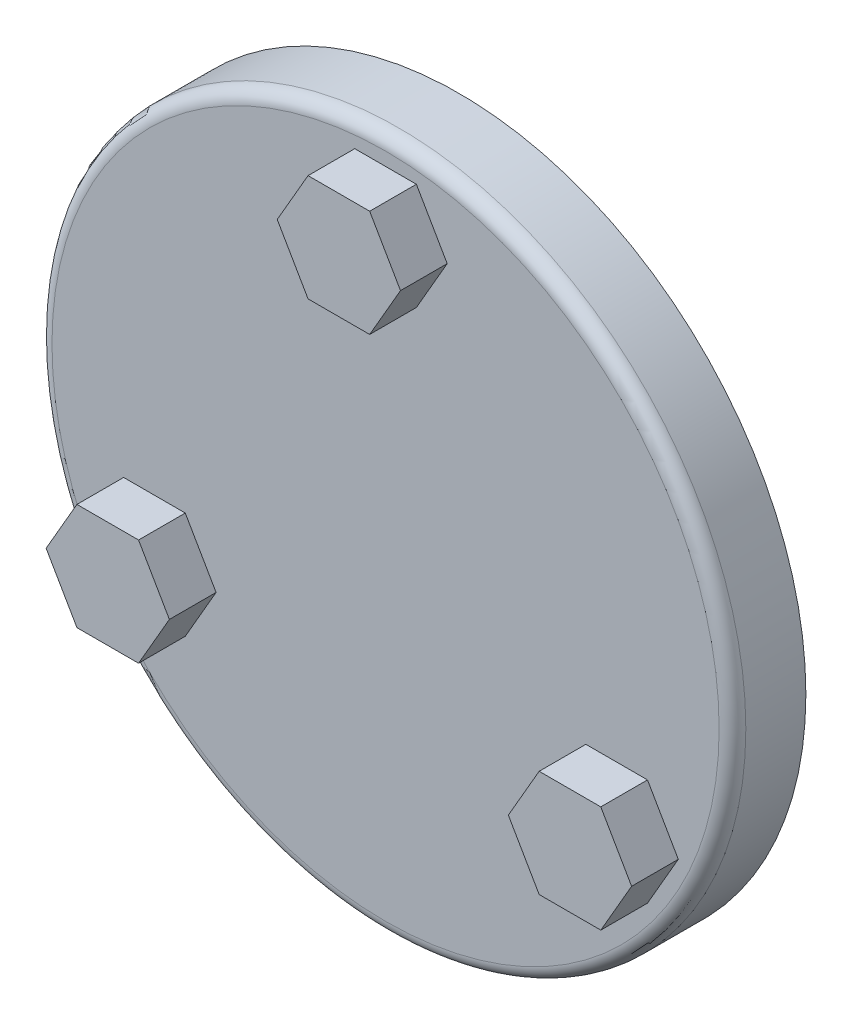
ISO-10303-21;
HEADER;
FILE_DESCRIPTION(('STEP AP214'),'2;1');
FILE_NAME('part.step','',(''),(''),'','','');
FILE_SCHEMA(('AUTOMOTIVE_DESIGN { 1 0 10303 214 1 1 1 1 }'));
ENDSEC;
DATA;
#1=APPLICATION_CONTEXT('core data for automotive mechanical design processes');
#2=APPLICATION_PROTOCOL_DEFINITION('international standard','automotive_design',2000,#1);
#3=PRODUCT_CONTEXT('',#1,'mechanical');
#4=PRODUCT('Part','Part','',(#3));
#5=PRODUCT_RELATED_PRODUCT_CATEGORY('part','',(#4));
#6=PRODUCT_DEFINITION_FORMATION('','',#4);
#7=PRODUCT_DEFINITION_CONTEXT('part definition',#1,'design');
#8=PRODUCT_DEFINITION('design','',#6,#7);
#9=PRODUCT_DEFINITION_SHAPE('','',#8);
#10=(LENGTH_UNIT() NAMED_UNIT(*) SI_UNIT(.MILLI.,.METRE.));
#11=(NAMED_UNIT(*) PLANE_ANGLE_UNIT() SI_UNIT($,.RADIAN.));
#12=(NAMED_UNIT(*) SI_UNIT($,.STERADIAN.) SOLID_ANGLE_UNIT());
#13=UNCERTAINTY_MEASURE_WITH_UNIT(LENGTH_MEASURE(1.E-05),#10,'distance_accuracy_value','');
#14=(GEOMETRIC_REPRESENTATION_CONTEXT(3) GLOBAL_UNCERTAINTY_ASSIGNED_CONTEXT((#13)) GLOBAL_UNIT_ASSIGNED_CONTEXT((#10,
#11,#12)) REPRESENTATION_CONTEXT('',''));
#15=CARTESIAN_POINT('',(0.,0.,0.));
#16=DIRECTION('',(0.,0.,1.));
#17=DIRECTION('',(1.,0.,0.));
#18=AXIS2_PLACEMENT_3D('',#15,#16,#17);
#19=CARTESIAN_POINT('',(16.165807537,-4.,9.));
#20=DIRECTION('',(0.,0.,1.));
#21=DIRECTION('',(-0.499999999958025,-0.866025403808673,0.));
#22=AXIS2_PLACEMENT_3D('',#19,#20,#21);
#23=PLANE('',#22);
#24=DIRECTION('',(0.500000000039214,-0.866025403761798,0.));
#25=VECTOR('',#24,1.);
#26=CARTESIAN_POINT('',(13.8564064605,-12.,9.));
#27=LINE('',#26,#25);
#28=CARTESIAN_POINT('',(12.701705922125,-10.,9.));
#29=VERTEX_POINT('',#28);
#30=CARTESIAN_POINT('',(15.011106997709,-13.9999999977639,9.));
#31=VERTEX_POINT('',#30);
#32=EDGE_CURVE('E263',#29,#31,#27,.T.);
#33=ORIENTED_EDGE('',*,*,#32,.T.);
#34=DIRECTION('',(1.,0.,0.));
#35=VECTOR('',#34,1.);
#36=CARTESIAN_POINT('',(17.3205080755,-14.,9.));
#37=LINE('',#36,#35);
#38=CARTESIAN_POINT('',(19.62990915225,-14.,9.));
#39=VERTEX_POINT('',#38);
#40=EDGE_CURVE('E258',#31,#39,#37,.T.);
#41=ORIENTED_EDGE('',*,*,#40,.T.);
#42=DIRECTION('',(0.500000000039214,0.866025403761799,0.));
#43=VECTOR('',#42,1.);
#44=CARTESIAN_POINT('',(20.7846096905,-12.,9.));
#45=LINE('',#44,#43);
#46=CARTESIAN_POINT('',(21.93931022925,-10.,9.));
#47=VERTEX_POINT('',#46);
#48=EDGE_CURVE('E259',#39,#47,#45,.T.);
#49=ORIENTED_EDGE('',*,*,#48,.T.);
#50=DIRECTION('',(-0.500000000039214,0.866025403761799,0.));
#51=VECTOR('',#50,1.);
#52=CARTESIAN_POINT('',(20.7846096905,-8.,9.));
#53=LINE('',#52,#51);
#54=CARTESIAN_POINT('',(19.6299091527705,-6.00000000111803,9.));
#55=VERTEX_POINT('',#54);
#56=EDGE_CURVE('E329',#47,#55,#53,.T.);
#57=ORIENTED_EDGE('',*,*,#56,.T.);
#58=DIRECTION('',(-1.,0.,0.));
#59=VECTOR('',#58,1.);
#60=CARTESIAN_POINT('',(17.3205080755,-6.,9.));
#61=LINE('',#60,#59);
#62=CARTESIAN_POINT('',(15.011106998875,-6.,9.));
#63=VERTEX_POINT('',#62);
#64=EDGE_CURVE('E250',#55,#63,#61,.T.);
#65=ORIENTED_EDGE('',*,*,#64,.T.);
#66=DIRECTION('',(-0.500000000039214,-0.866025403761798,0.));
#67=VECTOR('',#66,1.);
#68=CARTESIAN_POINT('',(13.8564064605,-8.,9.));
#69=LINE('',#68,#67);
#70=EDGE_CURVE('E245',#63,#29,#69,.T.);
#71=ORIENTED_EDGE('',*,*,#70,.T.);
#72=EDGE_LOOP('',(#33,#41,#49,#57,#65,#71));
#73=FACE_BOUND('',#72,.T.);
#74=ADVANCED_FACE('F16',(#73),#23,.T.);
#75=CARTESIAN_POINT('',(-4.618802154,16.,9.));
#76=DIRECTION('',(0.,0.,1.));
#77=DIRECTION('',(1.,0.,0.));
#78=AXIS2_PLACEMENT_3D('',#75,#76,#77);
#79=PLANE('',#78);
#80=DIRECTION('',(0.500000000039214,0.866025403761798,0.));
#81=VECTOR('',#80,1.);
#82=CARTESIAN_POINT('',(3.4641016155,18.,9.));
#83=LINE('',#82,#81);
#84=CARTESIAN_POINT('',(2.309401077,16.,9.));
#85=VERTEX_POINT('',#84);
#86=CARTESIAN_POINT('',(4.61880215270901,19.999999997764,9.));
#87=VERTEX_POINT('',#86);
#88=EDGE_CURVE('E235',#85,#87,#83,.T.);
#89=ORIENTED_EDGE('',*,*,#88,.T.);
#90=DIRECTION('',(-0.500000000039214,0.866025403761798,0.));
#91=VECTOR('',#90,1.);
#92=CARTESIAN_POINT('',(3.4641016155,22.,9.));
#93=LINE('',#92,#91);
#94=CARTESIAN_POINT('',(2.309401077,24.,9.));
#95=VERTEX_POINT('',#94);
#96=EDGE_CURVE('E227',#87,#95,#93,.T.);
#97=ORIENTED_EDGE('',*,*,#96,.T.);
#98=DIRECTION('',(-1.,0.,0.));
#99=VECTOR('',#98,1.);
#100=CARTESIAN_POINT('',(0.,24.,9.));
#101=LINE('',#100,#99);
#102=CARTESIAN_POINT('',(-2.309401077,24.,9.));
#103=VERTEX_POINT('',#102);
#104=EDGE_CURVE('E228',#95,#103,#101,.T.);
#105=ORIENTED_EDGE('',*,*,#104,.T.);
#106=DIRECTION('',(-0.500000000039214,-0.866025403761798,0.));
#107=VECTOR('',#106,1.);
#108=CARTESIAN_POINT('',(-3.4641016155,22.,9.));
#109=LINE('',#108,#107);
#110=CARTESIAN_POINT('',(-4.6188021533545,20.000000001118,9.));
#111=VERTEX_POINT('',#110);
#112=EDGE_CURVE('E249',#103,#111,#109,.T.);
#113=ORIENTED_EDGE('',*,*,#112,.T.);
#114=DIRECTION('',(0.500000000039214,-0.866025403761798,0.));
#115=VECTOR('',#114,1.);
#116=CARTESIAN_POINT('',(-3.4641016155,18.,9.));
#117=LINE('',#116,#115);
#118=CARTESIAN_POINT('',(-2.309401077,16.,9.));
#119=VERTEX_POINT('',#118);
#120=EDGE_CURVE('E215',#111,#119,#117,.T.);
#121=ORIENTED_EDGE('',*,*,#120,.T.);
#122=DIRECTION('',(1.,0.,0.));
#123=VECTOR('',#122,1.);
#124=CARTESIAN_POINT('',(0.,16.,9.));
#125=LINE('',#124,#123);
#126=EDGE_CURVE('E239',#119,#85,#125,.T.);
#127=ORIENTED_EDGE('',*,*,#126,.T.);
#128=EDGE_LOOP('',(#89,#97,#105,#113,#121,#127));
#129=FACE_BOUND('',#128,.T.);
#130=ADVANCED_FACE('F376',(#129),#79,.T.);
#131=CARTESIAN_POINT('',(-11.547005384,-12.,9.));
#132=DIRECTION('',(0.,0.,1.));
#133=DIRECTION('',(-0.499999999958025,0.866025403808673,0.));
#134=AXIS2_PLACEMENT_3D('',#131,#132,#133);
#135=PLANE('',#134);
#136=DIRECTION('',(-1.,0.,0.));
#137=VECTOR('',#136,1.);
#138=CARTESIAN_POINT('',(-17.3205080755,-6.,9.));
#139=LINE('',#138,#137);
#140=CARTESIAN_POINT('',(-15.011106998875,-6.,9.));
#141=VERTEX_POINT('',#140);
#142=CARTESIAN_POINT('',(-19.629909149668,-6.,9.));
#143=VERTEX_POINT('',#142);
#144=EDGE_CURVE('E206',#141,#143,#139,.T.);
#145=ORIENTED_EDGE('',*,*,#144,.T.);
#146=DIRECTION('',(-0.500000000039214,-0.866025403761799,0.));
#147=VECTOR('',#146,1.);
#148=CARTESIAN_POINT('',(-20.7846096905,-8.,9.));
#149=LINE('',#148,#147);
#150=CARTESIAN_POINT('',(-21.93931022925,-10.,9.));
#151=VERTEX_POINT('',#150);
#152=EDGE_CURVE('E201',#143,#151,#149,.T.);
#153=ORIENTED_EDGE('',*,*,#152,.T.);
#154=DIRECTION('',(0.500000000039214,-0.866025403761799,0.));
#155=VECTOR('',#154,1.);
#156=CARTESIAN_POINT('',(-20.7846096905,-12.,9.));
#157=LINE('',#156,#155);
#158=CARTESIAN_POINT('',(-19.62990915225,-14.,9.));
#159=VERTEX_POINT('',#158);
#160=EDGE_CURVE('E202',#151,#159,#157,.T.);
#161=ORIENTED_EDGE('',*,*,#160,.T.);
#162=DIRECTION('',(1.,0.,0.));
#163=VECTOR('',#162,1.);
#164=CARTESIAN_POINT('',(-17.3205080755,-14.,9.));
#165=LINE('',#164,#163);
#166=CARTESIAN_POINT('',(-15.011107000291,-14.,9.));
#167=VERTEX_POINT('',#166);
#168=EDGE_CURVE('E214',#159,#167,#165,.T.);
#169=ORIENTED_EDGE('',*,*,#168,.T.);
#170=DIRECTION('',(0.500000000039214,0.866025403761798,0.));
#171=VECTOR('',#170,1.);
#172=CARTESIAN_POINT('',(-13.8564064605,-12.,9.));
#173=LINE('',#172,#171);
#174=CARTESIAN_POINT('',(-12.701705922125,-10.,9.));
#175=VERTEX_POINT('',#174);
#176=EDGE_CURVE('E97',#167,#175,#173,.T.);
#177=ORIENTED_EDGE('',*,*,#176,.T.);
#178=DIRECTION('',(-0.500000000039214,0.866025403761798,0.));
#179=VECTOR('',#178,1.);
#180=CARTESIAN_POINT('',(-13.8564064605,-8.,9.));
#181=LINE('',#180,#179);
#182=EDGE_CURVE('E210',#175,#141,#181,.T.);
#183=ORIENTED_EDGE('',*,*,#182,.T.);
#184=EDGE_LOOP('',(#145,#153,#161,#169,#177,#183));
#185=FACE_BOUND('',#184,.T.);
#186=ADVANCED_FACE('F373',(#185),#135,.T.);
#187=CARTESIAN_POINT('',(-26.312,-26.312,0.));
#188=DIRECTION('',(0.,0.,1.));
#189=DIRECTION('',(1.,0.,0.));
#190=AXIS2_PLACEMENT_3D('',#187,#188,#189);
#191=PLANE('',#190);
#192=CARTESIAN_POINT('',(0.,0.,0.));
#193=DIRECTION('',(0.,0.,-1.));
#194=DIRECTION('',(-1.,0.,0.));
#195=AXIS2_PLACEMENT_3D('',#192,#193,#194);
#196=CIRCLE('',#195,26.);
#197=CARTESIAN_POINT('',(-26.,0.,0.));
#198=VERTEX_POINT('',#197);
#199=EDGE_CURVE('E20',#198,#198,#196,.T.);
#200=ORIENTED_EDGE('',*,*,#199,.T.);
#201=EDGE_LOOP('',(#200));
#202=FACE_BOUND('',#201,.T.);
#203=ADVANCED_FACE('F375',(#202),#191,.F.);
#204=CARTESIAN_POINT('',(19.629909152,-6.,5.5));
#205=DIRECTION('',(-0.866025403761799,-0.500000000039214,0.));
#206=DIRECTION('',(0.500000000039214,-0.866025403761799,0.));
#207=AXIS2_PLACEMENT_3D('',#204,#205,#206);
#208=PLANE('',#207);
#209=DIRECTION('',(0.,0.,1.));
#210=VECTOR('',#209,1.);
#211=CARTESIAN_POINT('',(19.629909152,-6.,7.25));
#212=LINE('',#211,#210);
#213=CARTESIAN_POINT('',(19.6299091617,-5.99999999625,5.5));
#214=VERTEX_POINT('',#213);
#215=EDGE_CURVE('E244',#214,#55,#212,.T.);
#216=ORIENTED_EDGE('',*,*,#215,.T.);
#217=ORIENTED_EDGE('',*,*,#56,.F.);
#218=DIRECTION('',(0.,0.,-1.));
#219=VECTOR('',#218,1.);
#220=CARTESIAN_POINT('',(21.939310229,-10.,7.25));
#221=LINE('',#220,#219);
#222=CARTESIAN_POINT('',(21.9393102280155,-9.99999998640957,5.5));
#223=VERTEX_POINT('',#222);
#224=EDGE_CURVE('E255',#47,#223,#221,.T.);
#225=ORIENTED_EDGE('',*,*,#224,.T.);
#226=DIRECTION('',(0.499999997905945,-0.866025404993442,0.));
#227=VECTOR('',#226,1.);
#228=CARTESIAN_POINT('',(19.6299091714,-5.999999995,5.5));
#229=LINE('',#228,#227);
#230=EDGE_CURVE('E88',#214,#223,#229,.T.);
#231=ORIENTED_EDGE('',*,*,#230,.F.);
#232=EDGE_LOOP('',(#216,#217,#225,#231));
#233=FACE_BOUND('',#232,.T.);
#234=ADVANCED_FACE('F342',(#233),#208,.F.);
#235=CARTESIAN_POINT('',(21.939310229,-10.,5.5));
#236=DIRECTION('',(-0.866025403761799,0.500000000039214,0.));
#237=DIRECTION('',(-0.500000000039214,-0.866025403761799,0.));
#238=AXIS2_PLACEMENT_3D('',#235,#236,#237);
#239=PLANE('',#238);
#240=ORIENTED_EDGE('',*,*,#224,.F.);
#241=ORIENTED_EDGE('',*,*,#48,.F.);
#242=DIRECTION('',(0.,0.,-1.));
#243=VECTOR('',#242,1.);
#244=CARTESIAN_POINT('',(19.629909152,-14.,7.25));
#245=LINE('',#244,#243);
#246=CARTESIAN_POINT('',(19.6299091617,-14.0000000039,5.5));
#247=VERTEX_POINT('',#246);
#248=EDGE_CURVE('E260',#39,#247,#245,.T.);
#249=ORIENTED_EDGE('',*,*,#248,.T.);
#250=DIRECTION('',(-0.499999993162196,-0.866025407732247,0.));
#251=VECTOR('',#250,1.);
#252=CARTESIAN_POINT('',(21.9393102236,-9.9999999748,5.5));
#253=LINE('',#252,#251);
#254=EDGE_CURVE('E178',#223,#247,#253,.T.);
#255=ORIENTED_EDGE('',*,*,#254,.F.);
#256=EDGE_LOOP('',(#240,#241,#249,#255));
#257=FACE_BOUND('',#256,.T.);
#258=ADVANCED_FACE('F345',(#257),#239,.F.);
#259=CARTESIAN_POINT('',(19.629909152,-14.,5.5));
#260=DIRECTION('',(0.,1.,0.));
#261=DIRECTION('',(-1.,0.,0.));
#262=AXIS2_PLACEMENT_3D('',#259,#260,#261);
#263=PLANE('',#262);
#264=ORIENTED_EDGE('',*,*,#248,.F.);
#265=ORIENTED_EDGE('',*,*,#40,.F.);
#266=DIRECTION('',(0.,0.,-1.));
#267=VECTOR('',#266,1.);
#268=CARTESIAN_POINT('',(15.011106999,-14.,7.25));
#269=LINE('',#268,#267);
#270=CARTESIAN_POINT('',(15.0111070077,-14.0000000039,5.5));
#271=VERTEX_POINT('',#270);
#272=EDGE_CURVE('E266',#31,#271,#269,.T.);
#273=ORIENTED_EDGE('',*,*,#272,.T.);
#274=DIRECTION('',(-1.,0.,0.));
#275=VECTOR('',#274,1.);
#276=CARTESIAN_POINT('',(0.,-14.0000000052,5.5));
#277=LINE('',#276,#275);
#278=EDGE_CURVE('E177',#247,#271,#277,.T.);
#279=ORIENTED_EDGE('',*,*,#278,.F.);
#280=EDGE_LOOP('',(#264,#265,#273,#279));
#281=FACE_BOUND('',#280,.T.);
#282=ADVANCED_FACE('F347',(#281),#263,.F.);
#283=CARTESIAN_POINT('',(15.011106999,-14.,5.5));
#284=DIRECTION('',(0.866025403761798,0.500000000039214,0.));
#285=DIRECTION('',(-0.500000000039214,0.866025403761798,0.));
#286=AXIS2_PLACEMENT_3D('',#283,#284,#285);
#287=PLANE('',#286);
#288=ORIENTED_EDGE('',*,*,#272,.F.);
#289=ORIENTED_EDGE('',*,*,#32,.F.);
#290=DIRECTION('',(0.,0.,-1.));
#291=VECTOR('',#290,1.);
#292=CARTESIAN_POINT('',(12.701705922,-10.,7.25));
#293=LINE('',#292,#291);
#294=CARTESIAN_POINT('',(12.701705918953,-9.99999998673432,5.5));
#295=VERTEX_POINT('',#294);
#296=EDGE_CURVE('E242',#29,#295,#293,.T.);
#297=ORIENTED_EDGE('',*,*,#296,.T.);
#298=DIRECTION('',(-0.50000000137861,0.866025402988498,0.));
#299=VECTOR('',#298,1.);
#300=CARTESIAN_POINT('',(15.0111070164,-14.0000000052,5.5));
#301=LINE('',#300,#299);
#302=EDGE_CURVE('E173',#271,#295,#301,.T.);
#303=ORIENTED_EDGE('',*,*,#302,.F.);
#304=EDGE_LOOP('',(#288,#289,#297,#303));
#305=FACE_BOUND('',#304,.T.);
#306=ADVANCED_FACE('F449',(#305),#287,.F.);
#307=CARTESIAN_POINT('',(12.701705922,-10.,5.5));
#308=DIRECTION('',(0.866025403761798,-0.500000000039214,0.));
#309=DIRECTION('',(0.500000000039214,0.866025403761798,0.));
#310=AXIS2_PLACEMENT_3D('',#307,#308,#309);
#311=PLANE('',#310);
#312=ORIENTED_EDGE('',*,*,#296,.F.);
#313=ORIENTED_EDGE('',*,*,#70,.F.);
#314=DIRECTION('',(0.,0.,-1.));
#315=VECTOR('',#314,1.);
#316=CARTESIAN_POINT('',(15.011106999,-6.,7.25));
#317=LINE('',#316,#315);
#318=CARTESIAN_POINT('',(15.0111070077,-5.99999999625,5.5));
#319=VERTEX_POINT('',#318);
#320=EDGE_CURVE('E246',#63,#319,#317,.T.);
#321=ORIENTED_EDGE('',*,*,#320,.T.);
#322=DIRECTION('',(0.50000000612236,0.866025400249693,0.));
#323=VECTOR('',#322,1.);
#324=CARTESIAN_POINT('',(12.7017059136,-9.9999999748,5.5));
#325=LINE('',#324,#323);
#326=EDGE_CURVE('E169',#295,#319,#325,.T.);
#327=ORIENTED_EDGE('',*,*,#326,.F.);
#328=EDGE_LOOP('',(#312,#313,#321,#327));
#329=FACE_BOUND('',#328,.T.);
#330=ADVANCED_FACE('F458',(#329),#311,.F.);
#331=CARTESIAN_POINT('',(15.011106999,-6.,5.5));
#332=DIRECTION('',(0.,-1.,0.));
#333=DIRECTION('',(1.,0.,0.));
#334=AXIS2_PLACEMENT_3D('',#331,#332,#333);
#335=PLANE('',#334);
#336=ORIENTED_EDGE('',*,*,#320,.F.);
#337=ORIENTED_EDGE('',*,*,#64,.F.);
#338=ORIENTED_EDGE('',*,*,#215,.F.);
#339=DIRECTION('',(1.,0.,0.));
#340=VECTOR('',#339,1.);
#341=CARTESIAN_POINT('',(0.,-5.999999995,5.5));
#342=LINE('',#341,#340);
#343=EDGE_CURVE('E168',#319,#214,#342,.T.);
#344=ORIENTED_EDGE('',*,*,#343,.F.);
#345=EDGE_LOOP('',(#336,#337,#338,#344));
#346=FACE_BOUND('',#345,.T.);
#347=ADVANCED_FACE('F468',(#346),#335,.F.);
#348=CARTESIAN_POINT('',(-4.618802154,20.,5.5));
#349=DIRECTION('',(0.866025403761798,-0.500000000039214,0.));
#350=DIRECTION('',(0.500000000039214,0.866025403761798,0.));
#351=AXIS2_PLACEMENT_3D('',#348,#349,#350);
#352=PLANE('',#351);
#353=DIRECTION('',(0.,0.,1.));
#354=VECTOR('',#353,1.);
#355=CARTESIAN_POINT('',(-4.618802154,20.,7.25));
#356=LINE('',#355,#354);
#357=CARTESIAN_POINT('',(-4.61880215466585,20.0000000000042,5.5));
#358=VERTEX_POINT('',#357);
#359=EDGE_CURVE('E219',#358,#111,#356,.T.);
#360=ORIENTED_EDGE('',*,*,#359,.T.);
#361=ORIENTED_EDGE('',*,*,#112,.F.);
#362=DIRECTION('',(0.,0.,-1.));
#363=VECTOR('',#362,1.);
#364=CARTESIAN_POINT('',(-2.309401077,24.,7.25));
#365=LINE('',#364,#363);
#366=CARTESIAN_POINT('',(-2.3094010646,23.999999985,5.5));
#367=VERTEX_POINT('',#366);
#368=EDGE_CURVE('E224',#103,#367,#365,.T.);
#369=ORIENTED_EDGE('',*,*,#368,.T.);
#370=DIRECTION('',(0.500000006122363,0.866025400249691,0.));
#371=VECTOR('',#370,1.);
#372=CARTESIAN_POINT('',(-4.618802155,20.0000000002,5.5));
#373=LINE('',#372,#371);
#374=EDGE_CURVE('E164',#358,#367,#373,.T.);
#375=ORIENTED_EDGE('',*,*,#374,.F.);
#376=EDGE_LOOP('',(#360,#361,#369,#375));
#377=FACE_BOUND('',#376,.T.);
#378=ADVANCED_FACE('F478',(#377),#352,.F.);
#379=CARTESIAN_POINT('',(-2.309401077,24.,9.));
#380=DIRECTION('',(0.,-1.,0.));
#381=DIRECTION('',(0.,0.,-1.));
#382=AXIS2_PLACEMENT_3D('',#379,#380,#381);
#383=PLANE('',#382);
#384=ORIENTED_EDGE('',*,*,#368,.F.);
#385=ORIENTED_EDGE('',*,*,#104,.F.);
#386=DIRECTION('',(0.,0.,-1.));
#387=VECTOR('',#386,1.);
#388=CARTESIAN_POINT('',(2.309401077,24.,7.25));
#389=LINE('',#388,#387);
#390=CARTESIAN_POINT('',(2.30940106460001,23.999999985,5.5));
#391=VERTEX_POINT('',#390);
#392=EDGE_CURVE('E232',#95,#391,#389,.T.);
#393=ORIENTED_EDGE('',*,*,#392,.T.);
#394=DIRECTION('',(1.,0.,0.));
#395=VECTOR('',#394,1.);
#396=CARTESIAN_POINT('',(0.,23.99999998,5.5));
#397=LINE('',#396,#395);
#398=EDGE_CURVE('E163',#367,#391,#397,.T.);
#399=ORIENTED_EDGE('',*,*,#398,.F.);
#400=EDGE_LOOP('',(#384,#385,#393,#399));
#401=FACE_BOUND('',#400,.T.);
#402=ADVANCED_FACE('F488',(#401),#383,.F.);
#403=CARTESIAN_POINT('',(2.309401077,24.,5.5));
#404=DIRECTION('',(-0.866025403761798,-0.500000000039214,0.));
#405=DIRECTION('',(0.500000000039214,-0.866025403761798,0.));
#406=AXIS2_PLACEMENT_3D('',#403,#404,#405);
#407=PLANE('',#406);
#408=ORIENTED_EDGE('',*,*,#392,.F.);
#409=ORIENTED_EDGE('',*,*,#96,.F.);
#410=DIRECTION('',(0.,0.,-1.));
#411=VECTOR('',#410,1.);
#412=CARTESIAN_POINT('',(4.618802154,20.,7.25));
#413=LINE('',#412,#411);
#414=CARTESIAN_POINT('',(4.61880215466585,20.0000000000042,5.5));
#415=VERTEX_POINT('',#414);
#416=EDGE_CURVE('E236',#87,#415,#413,.T.);
#417=ORIENTED_EDGE('',*,*,#416,.T.);
#418=DIRECTION('',(0.500000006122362,-0.866025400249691,0.));
#419=VECTOR('',#418,1.);
#420=CARTESIAN_POINT('',(2.30940105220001,23.99999998,5.5));
#421=LINE('',#420,#419);
#422=EDGE_CURVE('E159',#391,#415,#421,.T.);
#423=ORIENTED_EDGE('',*,*,#422,.F.);
#424=EDGE_LOOP('',(#408,#409,#417,#423));
#425=FACE_BOUND('',#424,.T.);
#426=ADVANCED_FACE('F498',(#425),#407,.F.);
#427=CARTESIAN_POINT('',(4.618802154,20.,5.5));
#428=DIRECTION('',(-0.866025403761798,0.500000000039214,0.));
#429=DIRECTION('',(-0.500000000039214,-0.866025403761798,0.));
#430=AXIS2_PLACEMENT_3D('',#427,#428,#429);
#431=PLANE('',#430);
#432=ORIENTED_EDGE('',*,*,#416,.F.);
#433=ORIENTED_EDGE('',*,*,#88,.F.);
#434=DIRECTION('',(0.,0.,-1.));
#435=VECTOR('',#434,1.);
#436=CARTESIAN_POINT('',(2.309401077,16.,7.25));
#437=LINE('',#436,#435);
#438=CARTESIAN_POINT('',(2.30940106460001,16.0000000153,5.5));
#439=VERTEX_POINT('',#438);
#440=EDGE_CURVE('E223',#85,#439,#437,.T.);
#441=ORIENTED_EDGE('',*,*,#440,.T.);
#442=DIRECTION('',(-0.500000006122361,-0.866025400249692,0.));
#443=VECTOR('',#442,1.);
#444=CARTESIAN_POINT('',(4.618802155,20.0000000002,5.5));
#445=LINE('',#444,#443);
#446=EDGE_CURVE('E155',#415,#439,#445,.T.);
#447=ORIENTED_EDGE('',*,*,#446,.F.);
#448=EDGE_LOOP('',(#432,#433,#441,#447));
#449=FACE_BOUND('',#448,.T.);
#450=ADVANCED_FACE('F508',(#449),#431,.F.);
#451=CARTESIAN_POINT('',(-2.309401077,16.,5.5));
#452=DIRECTION('',(0.,1.,0.));
#453=DIRECTION('',(0.,0.,1.));
#454=AXIS2_PLACEMENT_3D('',#451,#452,#453);
#455=PLANE('',#454);
#456=ORIENTED_EDGE('',*,*,#440,.F.);
#457=ORIENTED_EDGE('',*,*,#126,.F.);
#458=DIRECTION('',(0.,0.,-1.));
#459=VECTOR('',#458,1.);
#460=CARTESIAN_POINT('',(-2.309401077,16.,7.25));
#461=LINE('',#460,#459);
#462=CARTESIAN_POINT('',(-2.3094010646,16.0000000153,5.5));
#463=VERTEX_POINT('',#462);
#464=EDGE_CURVE('E211',#119,#463,#461,.T.);
#465=ORIENTED_EDGE('',*,*,#464,.T.);
#466=DIRECTION('',(-1.,0.,0.));
#467=VECTOR('',#466,1.);
#468=CARTESIAN_POINT('',(0.,16.0000000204,5.5));
#469=LINE('',#468,#467);
#470=EDGE_CURVE('E154',#439,#463,#469,.T.);
#471=ORIENTED_EDGE('',*,*,#470,.F.);
#472=EDGE_LOOP('',(#456,#457,#465,#471));
#473=FACE_BOUND('',#472,.T.);
#474=ADVANCED_FACE('F518',(#473),#455,.F.);
#475=CARTESIAN_POINT('',(-2.309401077,16.,5.5));
#476=DIRECTION('',(0.866025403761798,0.500000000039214,0.));
#477=DIRECTION('',(-0.500000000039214,0.866025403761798,0.));
#478=AXIS2_PLACEMENT_3D('',#475,#476,#477);
#479=PLANE('',#478);
#480=ORIENTED_EDGE('',*,*,#464,.F.);
#481=ORIENTED_EDGE('',*,*,#120,.F.);
#482=ORIENTED_EDGE('',*,*,#359,.F.);
#483=DIRECTION('',(-0.500000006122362,0.866025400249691,0.));
#484=VECTOR('',#483,1.);
#485=CARTESIAN_POINT('',(-2.30940105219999,16.0000000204,5.5));
#486=LINE('',#485,#484);
#487=EDGE_CURVE('E119',#463,#358,#486,.T.);
#488=ORIENTED_EDGE('',*,*,#487,.F.);
#489=EDGE_LOOP('',(#480,#481,#482,#488));
#490=FACE_BOUND('',#489,.T.);
#491=ADVANCED_FACE('F528',(#490),#479,.F.);
#492=CARTESIAN_POINT('',(-15.011106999,-14.,5.5));
#493=DIRECTION('',(0.,1.,0.));
#494=DIRECTION('',(-1.,0.,0.));
#495=AXIS2_PLACEMENT_3D('',#492,#493,#494);
#496=PLANE('',#495);
#497=DIRECTION('',(0.,0.,1.));
#498=VECTOR('',#497,1.);
#499=CARTESIAN_POINT('',(-15.011106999,-14.,7.25));
#500=LINE('',#499,#498);
#501=CARTESIAN_POINT('',(-15.0111070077,-14.0000000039,5.5));
#502=VERTEX_POINT('',#501);
#503=EDGE_CURVE('E110',#502,#167,#500,.T.);
#504=ORIENTED_EDGE('',*,*,#503,.T.);
#505=ORIENTED_EDGE('',*,*,#168,.F.);
#506=DIRECTION('',(0.,0.,-1.));
#507=VECTOR('',#506,1.);
#508=CARTESIAN_POINT('',(-19.629909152,-14.,7.25));
#509=LINE('',#508,#507);
#510=CARTESIAN_POINT('',(-19.6299091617,-14.0000000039,5.5));
#511=VERTEX_POINT('',#510);
#512=EDGE_CURVE('E112',#159,#511,#509,.T.);
#513=ORIENTED_EDGE('',*,*,#512,.T.);
#514=DIRECTION('',(-1.,0.,0.));
#515=VECTOR('',#514,1.);
#516=CARTESIAN_POINT('',(0.,-14.0000000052,5.5));
#517=LINE('',#516,#515);
#518=EDGE_CURVE('E106',#502,#511,#517,.T.);
#519=ORIENTED_EDGE('',*,*,#518,.F.);
#520=EDGE_LOOP('',(#504,#505,#513,#519));
#521=FACE_BOUND('',#520,.T.);
#522=ADVANCED_FACE('F108',(#521),#496,.F.);
#523=CARTESIAN_POINT('',(-19.629909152,-14.,5.5));
#524=DIRECTION('',(0.866025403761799,0.500000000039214,0.));
#525=DIRECTION('',(-0.500000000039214,0.866025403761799,0.));
#526=AXIS2_PLACEMENT_3D('',#523,#524,#525);
#527=PLANE('',#526);
#528=ORIENTED_EDGE('',*,*,#512,.F.);
#529=ORIENTED_EDGE('',*,*,#160,.F.);
#530=DIRECTION('',(0.,0.,-1.));
#531=VECTOR('',#530,1.);
#532=CARTESIAN_POINT('',(-21.939310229,-10.,7.25));
#533=LINE('',#532,#531);
#534=CARTESIAN_POINT('',(-21.9393102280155,-9.99999998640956,5.5));
#535=VERTEX_POINT('',#534);
#536=EDGE_CURVE('E203',#151,#535,#533,.T.);
#537=ORIENTED_EDGE('',*,*,#536,.T.);
#538=DIRECTION('',(-0.499999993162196,0.866025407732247,0.));
#539=VECTOR('',#538,1.);
#540=CARTESIAN_POINT('',(-19.6299091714,-14.0000000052,5.5));
#541=LINE('',#540,#539);
#542=EDGE_CURVE('E118',#511,#535,#541,.T.);
#543=ORIENTED_EDGE('',*,*,#542,.F.);
#544=EDGE_LOOP('',(#528,#529,#537,#543));
#545=FACE_BOUND('',#544,.T.);
#546=ADVANCED_FACE('F547',(#545),#527,.F.);
#547=CARTESIAN_POINT('',(-21.939310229,-10.,5.5));
#548=DIRECTION('',(0.866025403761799,-0.500000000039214,0.));
#549=DIRECTION('',(0.500000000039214,0.866025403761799,0.));
#550=AXIS2_PLACEMENT_3D('',#547,#548,#549);
#551=PLANE('',#550);
#552=ORIENTED_EDGE('',*,*,#536,.F.);
#553=ORIENTED_EDGE('',*,*,#152,.F.);
#554=DIRECTION('',(0.,0.,-1.));
#555=VECTOR('',#554,1.);
#556=CARTESIAN_POINT('',(-19.629909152,-6.,7.25));
#557=LINE('',#556,#555);
#558=CARTESIAN_POINT('',(-19.6299091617,-5.99999999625,5.5));
#559=VERTEX_POINT('',#558);
#560=EDGE_CURVE('E207',#143,#559,#557,.T.);
#561=ORIENTED_EDGE('',*,*,#560,.T.);
#562=DIRECTION('',(0.499999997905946,0.866025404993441,0.));
#563=VECTOR('',#562,1.);
#564=CARTESIAN_POINT('',(-21.9393102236,-9.9999999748,5.5));
#565=LINE('',#564,#563);
#566=EDGE_CURVE('E145',#535,#559,#565,.T.);
#567=ORIENTED_EDGE('',*,*,#566,.F.);
#568=EDGE_LOOP('',(#552,#553,#561,#567));
#569=FACE_BOUND('',#568,.T.);
#570=ADVANCED_FACE('F556',(#569),#551,.F.);
#571=CARTESIAN_POINT('',(-19.629909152,-6.,5.5));
#572=DIRECTION('',(0.,-1.,0.));
#573=DIRECTION('',(1.,0.,0.));
#574=AXIS2_PLACEMENT_3D('',#571,#572,#573);
#575=PLANE('',#574);
#576=ORIENTED_EDGE('',*,*,#560,.F.);
#577=ORIENTED_EDGE('',*,*,#144,.F.);
#578=DIRECTION('',(0.,0.,-1.));
#579=VECTOR('',#578,1.);
#580=CARTESIAN_POINT('',(-15.011106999,-6.,7.25));
#581=LINE('',#580,#579);
#582=CARTESIAN_POINT('',(-15.0111070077,-5.99999999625,5.5));
#583=VERTEX_POINT('',#582);
#584=EDGE_CURVE('E126',#141,#583,#581,.T.);
#585=ORIENTED_EDGE('',*,*,#584,.T.);
#586=DIRECTION('',(1.,0.,0.));
#587=VECTOR('',#586,1.);
#588=CARTESIAN_POINT('',(0.,-5.999999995,5.5));
#589=LINE('',#588,#587);
#590=EDGE_CURVE('E141',#559,#583,#589,.T.);
#591=ORIENTED_EDGE('',*,*,#590,.F.);
#592=EDGE_LOOP('',(#576,#577,#585,#591));
#593=FACE_BOUND('',#592,.T.);
#594=ADVANCED_FACE('F323',(#593),#575,.F.);
#595=CARTESIAN_POINT('',(-15.011106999,-6.,5.5));
#596=DIRECTION('',(-0.866025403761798,-0.500000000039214,0.));
#597=DIRECTION('',(0.500000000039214,-0.866025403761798,0.));
#598=AXIS2_PLACEMENT_3D('',#595,#596,#597);
#599=PLANE('',#598);
#600=ORIENTED_EDGE('',*,*,#584,.F.);
#601=ORIENTED_EDGE('',*,*,#182,.F.);
#602=DIRECTION('',(0.,0.,-1.));
#603=VECTOR('',#602,1.);
#604=CARTESIAN_POINT('',(-12.701705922,-10.,7.25));
#605=LINE('',#604,#603);
#606=CARTESIAN_POINT('',(-12.701705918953,-9.99999998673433,5.5));
#607=VERTEX_POINT('',#606);
#608=EDGE_CURVE('E36',#175,#607,#605,.T.);
#609=ORIENTED_EDGE('',*,*,#608,.T.);
#610=DIRECTION('',(0.500000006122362,-0.866025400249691,0.));
#611=VECTOR('',#610,1.);
#612=CARTESIAN_POINT('',(-15.0111070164,-5.999999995,5.5));
#613=LINE('',#612,#611);
#614=EDGE_CURVE('E131',#583,#607,#613,.T.);
#615=ORIENTED_EDGE('',*,*,#614,.F.);
#616=EDGE_LOOP('',(#600,#601,#609,#615));
#617=FACE_BOUND('',#616,.T.);
#618=ADVANCED_FACE('F324',(#617),#599,.F.);
#619=CARTESIAN_POINT('',(-12.701705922,-10.,5.5));
#620=DIRECTION('',(-0.866025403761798,0.500000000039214,0.));
#621=DIRECTION('',(-0.500000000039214,-0.866025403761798,0.));
#622=AXIS2_PLACEMENT_3D('',#619,#620,#621);
#623=PLANE('',#622);
#624=ORIENTED_EDGE('',*,*,#608,.F.);
#625=ORIENTED_EDGE('',*,*,#176,.F.);
#626=ORIENTED_EDGE('',*,*,#503,.F.);
#627=DIRECTION('',(-0.500000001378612,-0.866025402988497,0.));
#628=VECTOR('',#627,1.);
#629=CARTESIAN_POINT('',(-12.7017059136,-9.9999999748,5.5));
#630=LINE('',#629,#628);
#631=EDGE_CURVE('E123',#607,#502,#630,.T.);
#632=ORIENTED_EDGE('',*,*,#631,.F.);
#633=EDGE_LOOP('',(#624,#625,#626,#632));
#634=FACE_BOUND('',#633,.T.);
#635=ADVANCED_FACE('F122',(#634),#623,.F.);
#636=CARTESIAN_POINT('',(0.,0.,4.5));
#637=DIRECTION('',(0.,0.,-1.));
#638=DIRECTION('',(-1.,0.,0.));
#639=AXIS2_PLACEMENT_3D('',#636,#637,#638);
#640=CYLINDRICAL_SURFACE('',#639,26.);
#641=ORIENTED_EDGE('',*,*,#199,.F.);
#642=EDGE_LOOP('',(#641));
#643=FACE_BOUND('',#642,.T.);
#644=CARTESIAN_POINT('',(0.,0.,4.5));
#645=DIRECTION('',(0.,0.,1.));
#646=DIRECTION('',(1.,0.,0.));
#647=AXIS2_PLACEMENT_3D('',#644,#645,#646);
#648=CIRCLE('',#647,26.);
#649=CARTESIAN_POINT('',(26.,0.,4.5));
#650=VERTEX_POINT('',#649);
#651=EDGE_CURVE('E27',#650,#650,#648,.T.);
#652=ORIENTED_EDGE('',*,*,#651,.F.);
#653=EDGE_LOOP('',(#652));
#654=FACE_BOUND('',#653,.T.);
#655=ADVANCED_FACE('F391',(#643,#654),#640,.T.);
#656=CARTESIAN_POINT('',(-25.3,-25.3,5.5));
#657=DIRECTION('',(0.,0.,1.));
#658=DIRECTION('',(1.,0.,0.));
#659=AXIS2_PLACEMENT_3D('',#656,#657,#658);
#660=PLANE('',#659);
#661=ORIENTED_EDGE('',*,*,#614,.T.);
#662=ORIENTED_EDGE('',*,*,#631,.T.);
#663=ORIENTED_EDGE('',*,*,#518,.T.);
#664=ORIENTED_EDGE('',*,*,#542,.T.);
#665=ORIENTED_EDGE('',*,*,#566,.T.);
#666=ORIENTED_EDGE('',*,*,#590,.T.);
#667=EDGE_LOOP('',(#661,#662,#663,#664,#665,#666));
#668=FACE_BOUND('',#667,.T.);
#669=ORIENTED_EDGE('',*,*,#470,.T.);
#670=ORIENTED_EDGE('',*,*,#487,.T.);
#671=ORIENTED_EDGE('',*,*,#374,.T.);
#672=ORIENTED_EDGE('',*,*,#398,.T.);
#673=ORIENTED_EDGE('',*,*,#422,.T.);
#674=ORIENTED_EDGE('',*,*,#446,.T.);
#675=EDGE_LOOP('',(#669,#670,#671,#672,#673,#674));
#676=FACE_BOUND('',#675,.T.);
#677=ORIENTED_EDGE('',*,*,#326,.T.);
#678=ORIENTED_EDGE('',*,*,#343,.T.);
#679=ORIENTED_EDGE('',*,*,#230,.T.);
#680=ORIENTED_EDGE('',*,*,#254,.T.);
#681=ORIENTED_EDGE('',*,*,#278,.T.);
#682=ORIENTED_EDGE('',*,*,#302,.T.);
#683=EDGE_LOOP('',(#677,#678,#679,#680,#681,#682));
#684=FACE_BOUND('',#683,.T.);
#685=CARTESIAN_POINT('',(0.,0.,5.5));
#686=DIRECTION('',(0.,0.,1.));
#687=DIRECTION('',(1.,0.,0.));
#688=AXIS2_PLACEMENT_3D('',#685,#686,#687);
#689=CIRCLE('',#688,25.);
#690=CARTESIAN_POINT('',(25.,0.,5.5));
#691=VERTEX_POINT('',#690);
#692=EDGE_CURVE('E11',#691,#691,#689,.F.);
#693=ORIENTED_EDGE('',*,*,#692,.F.);
#694=EDGE_LOOP('',(#693));
#695=FACE_BOUND('',#694,.T.);
#696=ADVANCED_FACE('F128',(#668,#676,#684,#695),#660,.T.);
#697=CARTESIAN_POINT('',(0.,0.,4.5));
#698=DIRECTION('',(0.,0.,1.));
#699=DIRECTION('',(1.,0.,0.));
#700=AXIS2_PLACEMENT_3D('',#697,#698,#699);
#701=TOROIDAL_SURFACE('',#700,25.,1.);
#702=ORIENTED_EDGE('',*,*,#651,.T.);
#703=EDGE_LOOP('',(#702));
#704=FACE_BOUND('',#703,.T.);
#705=ORIENTED_EDGE('',*,*,#692,.T.);
#706=EDGE_LOOP('',(#705));
#707=FACE_BOUND('',#706,.T.);
#708=ADVANCED_FACE('F18',(#704,#707),#701,.T.);
#709=CLOSED_SHELL('',(#74,#130,#186,#203,#234,#258,#282,#306,#330,#347,#378,#402,#426,#450,#474,
#491,#522,#546,#570,#594,#618,#635,#655,#696,#708));
#710=MANIFOLD_SOLID_BREP('B1',#709);
#711=ADVANCED_BREP_SHAPE_REPRESENTATION('',(#18,#710),#14);
#712=SHAPE_DEFINITION_REPRESENTATION(#9,#711);
ENDSEC;
END-ISO-10303-21;
